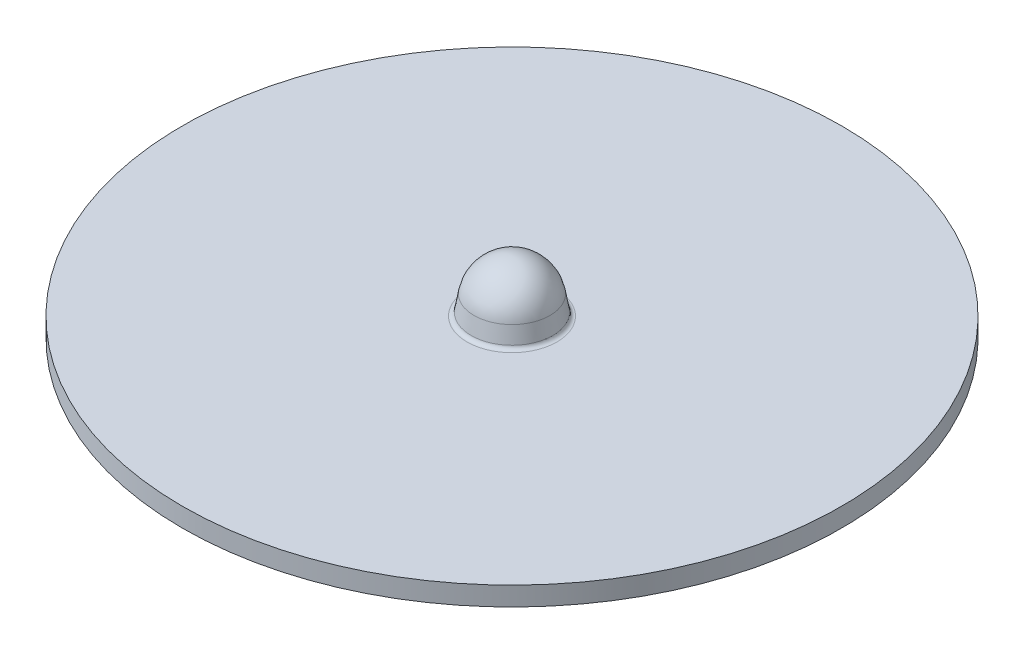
ISO-10303-21;
HEADER;
FILE_DESCRIPTION(('STEP AP214'),'2;1');
FILE_NAME('part.step','',(''),(''),'','','');
FILE_SCHEMA(('AUTOMOTIVE_DESIGN { 1 0 10303 214 1 1 1 1 }'));
ENDSEC;
DATA;
#1=APPLICATION_CONTEXT('core data for automotive mechanical design processes');
#2=APPLICATION_PROTOCOL_DEFINITION('international standard','automotive_design',2000,#1);
#3=PRODUCT_CONTEXT('',#1,'mechanical');
#4=PRODUCT('Part','Part','',(#3));
#5=PRODUCT_RELATED_PRODUCT_CATEGORY('part','',(#4));
#6=PRODUCT_DEFINITION_FORMATION('','',#4);
#7=PRODUCT_DEFINITION_CONTEXT('part definition',#1,'design');
#8=PRODUCT_DEFINITION('design','',#6,#7);
#9=PRODUCT_DEFINITION_SHAPE('','',#8);
#10=(LENGTH_UNIT() NAMED_UNIT(*) SI_UNIT(.MILLI.,.METRE.));
#11=(NAMED_UNIT(*) PLANE_ANGLE_UNIT() SI_UNIT($,.RADIAN.));
#12=(NAMED_UNIT(*) SI_UNIT($,.STERADIAN.) SOLID_ANGLE_UNIT());
#13=UNCERTAINTY_MEASURE_WITH_UNIT(LENGTH_MEASURE(1.E-05),#10,'distance_accuracy_value','');
#14=(GEOMETRIC_REPRESENTATION_CONTEXT(3) GLOBAL_UNCERTAINTY_ASSIGNED_CONTEXT((#13)) GLOBAL_UNIT_ASSIGNED_CONTEXT((#10,
#11,#12)) REPRESENTATION_CONTEXT('',''));
#15=CARTESIAN_POINT('',(0.,0.,0.));
#16=DIRECTION('',(0.,0.,1.));
#17=DIRECTION('',(1.,0.,0.));
#18=AXIS2_PLACEMENT_3D('',#15,#16,#17);
#19=CARTESIAN_POINT('',(0.,0.609731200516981,0.0222079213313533));
#20=DIRECTION('',(1.,0.,0.));
#21=DIRECTION('',(0.,0.,-1.));
#22=AXIS2_PLACEMENT_3D('',#19,#20,#21);
#23=CIRCLE('',#22,0.9652);
#24=TRIMMED_CURVE('',#23,(PARAMETER_VALUE(-1.54778567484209)),
(PARAMETER_VALUE(1.54778567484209)),.T.,.PARAMETER.);
#25=CARTESIAN_POINT('',(0.,0.609731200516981,0.));
#26=DIRECTION('',(0.,-1.,0.));
#27=AXIS1_PLACEMENT('',#25,#26);
#28=SURFACE_OF_REVOLUTION('',#24,#27);
#29=CARTESIAN_POINT('',(0.,1.57467567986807,0.));
#30=VERTEX_POINT('',#29);
#31=VERTEX_LOOP('',#30);
#32=FACE_BOUND('',#31,.T.);
#33=CARTESIAN_POINT('',(0.,0.777336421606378,0.));
#34=DIRECTION('',(0.,-1.,0.));
#35=DIRECTION('',(0.,0.,-1.));
#36=AXIS2_PLACEMENT_3D('',#33,#34,#35);
#37=CIRCLE('',#36,0.928328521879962);
#38=CARTESIAN_POINT('',(0.,0.777336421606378,-0.928328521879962));
#39=VERTEX_POINT('',#38);
#40=EDGE_CURVE('E155',#39,#39,#37,.T.);
#41=ORIENTED_EDGE('',*,*,#40,.T.);
#42=EDGE_LOOP('',(#41));
#43=FACE_BOUND('',#42,.T.);
#44=ADVANCED_FACE('F18',(#32,#43),#28,.T.);
#45=CARTESIAN_POINT('',(0.,0.00913079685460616,0.));
#46=DIRECTION('',(0.,-1.,0.));
#47=DIRECTION('',(0.,0.,-1.));
#48=AXIS2_PLACEMENT_3D('',#45,#46,#47);
#49=CONICAL_SURFACE('',#48,1.06378390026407,0.174532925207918);
#50=ORIENTED_EDGE('',*,*,#40,.F.);
#51=EDGE_LOOP('',(#50));
#52=FACE_BOUND('',#51,.T.);
#53=CARTESIAN_POINT('',(0.,0.00913079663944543,0.));
#54=DIRECTION('',(0.,-1.,0.));
#55=DIRECTION('',(0.,0.,-1.));
#56=AXIS2_PLACEMENT_3D('',#53,#54,#55);
#57=CIRCLE('',#56,1.06378390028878);
#58=CARTESIAN_POINT('',(0.,0.00913079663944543,-1.06378390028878));
#59=VERTEX_POINT('',#58);
#60=EDGE_CURVE('E56',#59,#59,#57,.F.);
#61=ORIENTED_EDGE('',*,*,#60,.F.);
#62=EDGE_LOOP('',(#61));
#63=FACE_BOUND('',#62,.T.);
#64=ADVANCED_FACE('F79',(#52,#63),#49,.F.);
#65=CARTESIAN_POINT('',(0.,0.2032,0.));
#66=DIRECTION('',(0.,-1.,0.));
#67=DIRECTION('',(0.,0.,-1.));
#68=AXIS2_PLACEMENT_3D('',#65,#66,#67);
#69=TOROIDAL_SURFACE('',#68,2.16440504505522,1.1176);
#70=ORIENTED_EDGE('',*,*,#60,.T.);
#71=EDGE_LOOP('',(#70));
#72=FACE_BOUND('',#71,.T.);
#73=CARTESIAN_POINT('',(0.,-0.9144,0.));
#74=DIRECTION('',(0.,-1.,0.));
#75=DIRECTION('',(0.,0.,-1.));
#76=AXIS2_PLACEMENT_3D('',#73,#74,#75);
#77=CIRCLE('',#76,2.16440504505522);
#78=CARTESIAN_POINT('',(0.,-0.9144,-2.16440504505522));
#79=VERTEX_POINT('',#78);
#80=CARTESIAN_POINT('',(0.,-0.9144,2.16440504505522));
#81=VERTEX_POINT('',#80);
#82=EDGE_CURVE('E53',#79,#81,#77,.T.);
#83=ORIENTED_EDGE('',*,*,#82,.T.);
#84=CARTESIAN_POINT('',(0.,-0.9144,0.));
#85=DIRECTION('',(0.,-1.,0.));
#86=DIRECTION('',(0.,0.,1.));
#87=AXIS2_PLACEMENT_3D('',#84,#85,#86);
#88=CIRCLE('',#87,2.16440504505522);
#89=EDGE_CURVE('E49',#81,#79,#88,.T.);
#90=ORIENTED_EDGE('',*,*,#89,.T.);
#91=EDGE_LOOP('',(#83,#90));
#92=FACE_BOUND('',#91,.T.);
#93=ADVANCED_FACE('F60',(#72,#92),#69,.T.);
#94=CARTESIAN_POINT('',(0.,0.609731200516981,0.0222079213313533));
#95=DIRECTION('',(1.,0.,0.));
#96=DIRECTION('',(0.,0.,-1.));
#97=AXIS2_PLACEMENT_3D('',#94,#95,#96);
#98=CIRCLE('',#97,1.8796);
#99=TRIMMED_CURVE('',#98,(PARAMETER_VALUE(-1.55898081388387)),
(PARAMETER_VALUE(1.55898081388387)),.T.,.PARAMETER.);
#100=CARTESIAN_POINT('',(0.,0.609731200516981,0.));
#101=DIRECTION('',(0.,-1.,0.));
#102=AXIS1_PLACEMENT('',#100,#101);
#103=SURFACE_OF_REVOLUTION('',#99,#102);
#104=CARTESIAN_POINT('',(0.,2.4892,0.));
#105=VERTEX_POINT('',#104);
#106=VERTEX_LOOP('',#105);
#107=FACE_BOUND('',#106,.T.);
#108=CARTESIAN_POINT('',(0.,0.936120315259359,0.));
#109=DIRECTION('',(0.,-1.,0.));
#110=DIRECTION('',(0.,0.,-1.));
#111=AXIS2_PLACEMENT_3D('',#108,#109,#110);
#112=CIRCLE('',#111,1.82883673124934);
#113=CARTESIAN_POINT('',(0.,0.936120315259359,-1.82883673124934));
#114=VERTEX_POINT('',#113);
#115=EDGE_CURVE('E61',#114,#114,#112,.T.);
#116=ORIENTED_EDGE('',*,*,#115,.F.);
#117=EDGE_LOOP('',(#116));
#118=FACE_BOUND('',#117,.T.);
#119=ADVANCED_FACE('F78',(#107,#118),#103,.F.);
#120=CARTESIAN_POINT('',(-15.875,-0.9144,0.));
#121=DIRECTION('',(0.,1.,0.));
#122=DIRECTION('',(0.,0.,1.));
#123=AXIS2_PLACEMENT_3D('',#120,#121,#122);
#124=PLANE('',#123);
#125=CARTESIAN_POINT('',(0.,-0.9144,0.));
#126=DIRECTION('',(0.,-1.,0.));
#127=DIRECTION('',(0.,0.,-1.));
#128=AXIS2_PLACEMENT_3D('',#125,#126,#127);
#129=CIRCLE('',#128,15.875);
#130=CARTESIAN_POINT('',(0.,-0.9144,-15.875));
#131=VERTEX_POINT('',#130);
#132=EDGE_CURVE('E135',#131,#131,#129,.F.);
#133=ORIENTED_EDGE('',*,*,#132,.F.);
#134=EDGE_LOOP('',(#133));
#135=FACE_BOUND('',#134,.T.);
#136=ORIENTED_EDGE('',*,*,#89,.F.);
#137=ORIENTED_EDGE('',*,*,#82,.F.);
#138=EDGE_LOOP('',(#136,#137));
#139=FACE_BOUND('',#138,.T.);
#140=ADVANCED_FACE('F52',(#135,#139),#124,.F.);
#141=CARTESIAN_POINT('',(0.,0.167914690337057,0.));
#142=DIRECTION('',(0.,-1.,0.));
#143=DIRECTION('',(0.,0.,-1.));
#144=AXIS2_PLACEMENT_3D('',#141,#142,#143);
#145=CONICAL_SURFACE('',#144,1.96429210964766,0.17453292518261);
#146=CARTESIAN_POINT('',(0.,0.167914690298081,0.));
#147=DIRECTION('',(0.,-1.,0.));
#148=DIRECTION('',(0.,0.,-1.));
#149=AXIS2_PLACEMENT_3D('',#146,#147,#148);
#150=CIRCLE('',#149,1.96429210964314);
#151=CARTESIAN_POINT('',(0.,0.167914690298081,-1.96429210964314));
#152=VERTEX_POINT('',#151);
#153=EDGE_CURVE('E128',#152,#152,#150,.F.);
#154=ORIENTED_EDGE('',*,*,#153,.T.);
#155=EDGE_LOOP('',(#154));
#156=FACE_BOUND('',#155,.T.);
#157=ORIENTED_EDGE('',*,*,#115,.T.);
#158=EDGE_LOOP('',(#157));
#159=FACE_BOUND('',#158,.T.);
#160=ADVANCED_FACE('F174',(#156,#159),#145,.T.);
#161=CARTESIAN_POINT('',(0.,0.,0.));
#162=DIRECTION('',(0.,-1.,0.));
#163=DIRECTION('',(0.,0.,-1.));
#164=AXIS2_PLACEMENT_3D('',#161,#162,#163);
#165=CYLINDRICAL_SURFACE('',#164,15.875);
#166=ORIENTED_EDGE('',*,*,#132,.T.);
#167=EDGE_LOOP('',(#166));
#168=FACE_BOUND('',#167,.T.);
#169=CARTESIAN_POINT('',(0.,0.,0.));
#170=DIRECTION('',(0.,-1.,0.));
#171=DIRECTION('',(0.,0.,-1.));
#172=AXIS2_PLACEMENT_3D('',#169,#170,#171);
#173=CIRCLE('',#172,15.875);
#174=CARTESIAN_POINT('',(0.,0.,-15.875));
#175=VERTEX_POINT('',#174);
#176=EDGE_CURVE('E121',#175,#175,#173,.T.);
#177=ORIENTED_EDGE('',*,*,#176,.T.);
#178=EDGE_LOOP('',(#177));
#179=FACE_BOUND('',#178,.T.);
#180=ADVANCED_FACE('F99',(#168,#179),#165,.T.);
#181=CARTESIAN_POINT('',(0.,0.2032,0.));
#182=DIRECTION('',(0.,-1.,0.));
#183=DIRECTION('',(0.,0.,-1.));
#184=AXIS2_PLACEMENT_3D('',#181,#182,#183);
#185=TOROIDAL_SURFACE('',#184,2.16440504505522,0.2032);
#186=CARTESIAN_POINT('',(0.,0.,0.));
#187=DIRECTION('',(0.,1.,0.));
#188=DIRECTION('',(0.,0.,1.));
#189=AXIS2_PLACEMENT_3D('',#186,#187,#188);
#190=CIRCLE('',#189,2.16440504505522);
#191=CARTESIAN_POINT('',(0.,0.,2.16440504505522));
#192=VERTEX_POINT('',#191);
#193=CARTESIAN_POINT('',(0.,0.,-2.16440504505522));
#194=VERTEX_POINT('',#193);
#195=EDGE_CURVE('E11',#192,#194,#190,.T.);
#196=ORIENTED_EDGE('',*,*,#195,.T.);
#197=CARTESIAN_POINT('',(0.,0.,0.));
#198=DIRECTION('',(0.,1.,0.));
#199=DIRECTION('',(0.,0.,-1.));
#200=AXIS2_PLACEMENT_3D('',#197,#198,#199);
#201=CIRCLE('',#200,2.16440504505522);
#202=EDGE_CURVE('E30',#194,#192,#201,.T.);
#203=ORIENTED_EDGE('',*,*,#202,.T.);
#204=EDGE_LOOP('',(#196,#203));
#205=FACE_BOUND('',#204,.T.);
#206=ORIENTED_EDGE('',*,*,#153,.F.);
#207=EDGE_LOOP('',(#206));
#208=FACE_BOUND('',#207,.T.);
#209=ADVANCED_FACE('F94',(#205,#208),#185,.F.);
#210=CARTESIAN_POINT('',(-15.875,0.,0.));
#211=DIRECTION('',(0.,-1.,0.));
#212=DIRECTION('',(0.,0.,-1.));
#213=AXIS2_PLACEMENT_3D('',#210,#211,#212);
#214=PLANE('',#213);
#215=ORIENTED_EDGE('',*,*,#202,.F.);
#216=ORIENTED_EDGE('',*,*,#195,.F.);
#217=EDGE_LOOP('',(#215,#216));
#218=FACE_BOUND('',#217,.T.);
#219=ORIENTED_EDGE('',*,*,#176,.F.);
#220=EDGE_LOOP('',(#219));
#221=FACE_BOUND('',#220,.T.);
#222=ADVANCED_FACE('F92',(#218,#221),#214,.F.);
#223=CLOSED_SHELL('',(#44,#64,#93,#119,#140,#160,#180,#209,#222));
#224=MANIFOLD_SOLID_BREP('B1',#223);
#225=ADVANCED_BREP_SHAPE_REPRESENTATION('',(#18,#224),#14);
#226=SHAPE_DEFINITION_REPRESENTATION(#9,#225);
ENDSEC;
END-ISO-10303-21;
